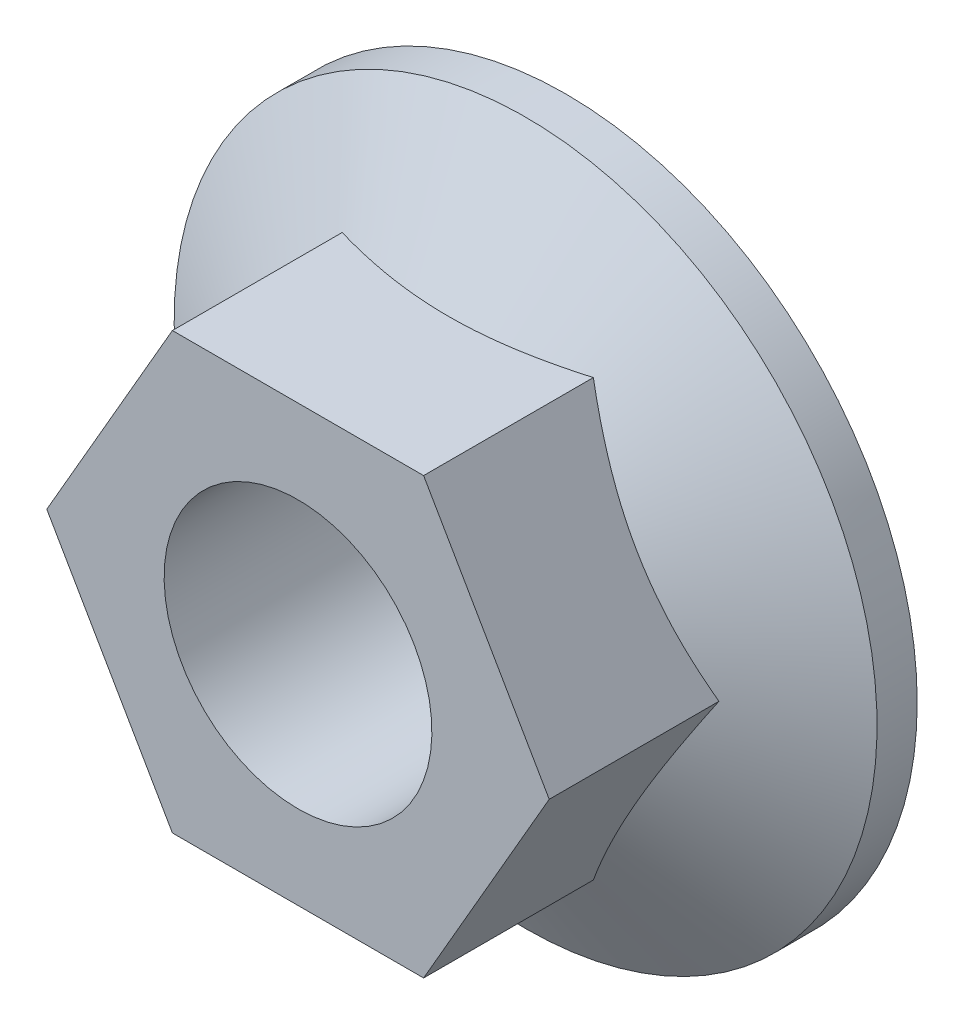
ISO-10303-21;
HEADER;
FILE_DESCRIPTION(('STEP AP214'),'2;1');
FILE_NAME('part.step','',(''),(''),'','','');
FILE_SCHEMA(('AUTOMOTIVE_DESIGN { 1 0 10303 214 1 1 1 1 }'));
ENDSEC;
DATA;
#1=APPLICATION_CONTEXT('core data for automotive mechanical design processes');
#2=APPLICATION_PROTOCOL_DEFINITION('international standard','automotive_design',2000,#1);
#3=PRODUCT_CONTEXT('',#1,'mechanical');
#4=PRODUCT('Part','Part','',(#3));
#5=PRODUCT_RELATED_PRODUCT_CATEGORY('part','',(#4));
#6=PRODUCT_DEFINITION_FORMATION('','',#4);
#7=PRODUCT_DEFINITION_CONTEXT('part definition',#1,'design');
#8=PRODUCT_DEFINITION('design','',#6,#7);
#9=PRODUCT_DEFINITION_SHAPE('','',#8);
#10=(LENGTH_UNIT() NAMED_UNIT(*) SI_UNIT(.MILLI.,.METRE.));
#11=(NAMED_UNIT(*) PLANE_ANGLE_UNIT() SI_UNIT($,.RADIAN.));
#12=(NAMED_UNIT(*) SI_UNIT($,.STERADIAN.) SOLID_ANGLE_UNIT());
#13=UNCERTAINTY_MEASURE_WITH_UNIT(LENGTH_MEASURE(1.E-05),#10,'distance_accuracy_value','');
#14=(GEOMETRIC_REPRESENTATION_CONTEXT(3) GLOBAL_UNCERTAINTY_ASSIGNED_CONTEXT((#13)) GLOBAL_UNIT_ASSIGNED_CONTEXT((#10,
#11,#12)) REPRESENTATION_CONTEXT('',''));
#15=CARTESIAN_POINT('',(0.,0.,0.));
#16=DIRECTION('',(0.,0.,1.));
#17=DIRECTION('',(1.,0.,0.));
#18=AXIS2_PLACEMENT_3D('',#15,#16,#17);
#19=CARTESIAN_POINT('',(-4.12805442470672,6.49999999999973,8.2535577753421));
#20=DIRECTION('',(0.,1.,0.));
#21=DIRECTION('',(-1.,0.,0.));
#22=AXIS2_PLACEMENT_3D('',#19,#20,#21);
#23=PLANE('',#22);
#24=DIRECTION('',(0.,0.,1.));
#25=VECTOR('',#24,1.);
#26=CARTESIAN_POINT('',(-3.75277674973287,6.49999999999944,8.2535577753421));
#27=LINE('',#26,#25);
#28=CARTESIAN_POINT('',(-3.75277674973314,6.4999999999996,8.));
#29=VERTEX_POINT('',#28);
#30=CARTESIAN_POINT('',(-3.7527767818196,6.4999999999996,2.92884447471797));
#31=VERTEX_POINT('',#30);
#32=EDGE_CURVE('E79',#29,#31,#27,.F.);
#33=ORIENTED_EDGE('',*,*,#32,.F.);
#34=DIRECTION('',(1.,0.,0.));
#35=VECTOR('',#34,1.);
#36=CARTESIAN_POINT('',(8.25610884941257,6.49999999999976,8.));
#37=LINE('',#36,#35);
#38=CARTESIAN_POINT('',(3.75277674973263,6.50000000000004,8.));
#39=VERTEX_POINT('',#38);
#40=EDGE_CURVE('E91',#29,#39,#37,.T.);
#41=ORIENTED_EDGE('',*,*,#40,.T.);
#42=DIRECTION('',(0.,0.,1.));
#43=VECTOR('',#42,1.);
#44=CARTESIAN_POINT('',(3.75277674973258,6.50000000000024,8.2535577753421));
#45=LINE('',#44,#43);
#46=CARTESIAN_POINT('',(3.75277673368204,6.5000000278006,2.92884447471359));
#47=VERTEX_POINT('',#46);
#48=EDGE_CURVE('E195',#47,#39,#45,.T.);
#49=ORIENTED_EDGE('',*,*,#48,.F.);
#50=CARTESIAN_POINT('',(-3.75277680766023,6.49999996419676,2.9288444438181));
#51=CARTESIAN_POINT('',(-3.44471104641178,6.49999998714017,3.01778469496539));
#52=CARTESIAN_POINT('',(-3.13420821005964,6.49999999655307,3.09921200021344));
#53=CARTESIAN_POINT('',(-2.50815863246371,6.5000000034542,3.24312465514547));
#54=CARTESIAN_POINT('',(-2.1926022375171,6.50000000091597,3.30556762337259));
#55=CARTESIAN_POINT('',(-1.56503027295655,6.49999999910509,3.40598347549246));
#56=CARTESIAN_POINT('',(-1.253103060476,6.49999999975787,3.44449173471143));
#57=CARTESIAN_POINT('',(-0.627449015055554,6.50000000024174,3.49618678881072));
#58=CARTESIAN_POINT('',(-0.313724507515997,6.50000000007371,3.5094010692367));
#59=CARTESIAN_POINT('',(0.3137244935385,6.49999999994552,3.50940106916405));
#60=CARTESIAN_POINT('',(0.627448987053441,6.49999999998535,3.49618678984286));
#61=CARTESIAN_POINT('',(1.25310300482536,6.50000000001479,3.44449174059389));
#62=CARTESIAN_POINT('',(1.56503020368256,6.50000000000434,3.40598348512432));
#63=CARTESIAN_POINT('',(2.19260214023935,6.4999999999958,3.3055676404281));
#64=CARTESIAN_POINT('',(2.50815852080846,6.49999999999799,3.24312467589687));
#65=CARTESIAN_POINT('',(3.13420807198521,6.50000000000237,3.09921203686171));
#66=CARTESIAN_POINT('',(3.44471089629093,6.50000000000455,3.01778474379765));
#67=CARTESIAN_POINT('',(3.75277664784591,6.50000000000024,2.92884451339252));
#68=B_SPLINE_CURVE_WITH_KNOTS('',3,(#50,#51,#52,#53,#54,#55,#56,#57,#58,#59,#60,#61,#62,#63,#64,
#65,#66,#67),.UNSPECIFIED.,.F.,.F.,(4,2,2,2,2,2,2,2,4),(0.,0.962238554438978,1.92660973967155,
2.8685503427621,3.80946680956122,4.7503832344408,5.69232379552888,6.65669493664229,
7.61893344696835),.UNSPECIFIED.);
#69=EDGE_CURVE('E86',#31,#47,#68,.T.);
#70=ORIENTED_EDGE('',*,*,#69,.F.);
#71=EDGE_LOOP('',(#33,#41,#49,#70));
#72=FACE_BOUND('',#71,.T.);
#73=ADVANCED_FACE('F15',(#72),#23,.T.);
#74=CARTESIAN_POINT('',(3.56513791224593,6.82500000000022,8.2535577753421));
#75=DIRECTION('',(0.866025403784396,0.500000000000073,0.));
#76=DIRECTION('',(-0.500000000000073,0.866025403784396,0.));
#77=AXIS2_PLACEMENT_3D('',#74,#75,#76);
#78=PLANE('',#77);
#79=ORIENTED_EDGE('',*,*,#48,.T.);
#80=DIRECTION('',(0.5,-0.866025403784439,0.));
#81=VECTOR('',#80,1.);
#82=CARTESIAN_POINT('',(3.75277674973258,6.50000000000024,8.));
#83=LINE('',#82,#81);
#84=CARTESIAN_POINT('',(7.50555349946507,6.08125962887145E-13,8.));
#85=VERTEX_POINT('',#84);
#86=EDGE_CURVE('E93',#39,#85,#83,.T.);
#87=ORIENTED_EDGE('',*,*,#86,.T.);
#88=DIRECTION('',(0.,0.,1.));
#89=VECTOR('',#88,1.);
#90=CARTESIAN_POINT('',(7.505553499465,4.87240456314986E-13,8.2535577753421));
#91=LINE('',#90,#89);
#92=CARTESIAN_POINT('',(7.50555349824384,4.62387174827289E-13,2.92884448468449));
#93=VERTEX_POINT('',#92);
#94=EDGE_CURVE('E190',#93,#85,#91,.T.);
#95=ORIENTED_EDGE('',*,*,#94,.F.);
#96=CARTESIAN_POINT('',(3.75277668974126,6.50000003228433,2.92884444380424));
#97=CARTESIAN_POINT('',(3.83526607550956,6.35712427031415,2.97646052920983));
#98=CARTESIAN_POINT('',(3.91806301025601,6.2137157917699,3.02191543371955));
#99=CARTESIAN_POINT('',(4.08432925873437,5.92573421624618,3.10790768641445));
#100=CARTESIAN_POINT('',(4.16779884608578,5.78116064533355,3.14844291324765));
#101=CARTESIAN_POINT('',(4.41954396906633,5.34512529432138,3.26187337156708));
#102=CARTESIAN_POINT('',(4.58881319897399,5.05194239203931,3.32639031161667));
#103=CARTESIAN_POINT('',(4.8421214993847,4.61319954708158,3.40204221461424));
#104=CARTESIAN_POINT('',(4.92540378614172,4.46895039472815,3.42359289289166));
#105=CARTESIAN_POINT('',(5.09234461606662,4.17980039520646,3.45972936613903));
#106=CARTESIAN_POINT('',(5.17600312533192,4.03489960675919,3.47431577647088));
#107=CARTESIAN_POINT('',(5.34346539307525,3.74484645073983,3.49615197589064));
#108=CARTESIAN_POINT('',(5.427268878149,3.59969455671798,3.50341009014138));
#109=CARTESIAN_POINT('',(5.59494857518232,3.30926480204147,3.51044185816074));
#110=CARTESIAN_POINT('',(5.67882478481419,3.16398694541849,3.51021574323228));
#111=CARTESIAN_POINT('',(5.90860384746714,2.76599793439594,3.49930951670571));
#112=CARTESIAN_POINT('',(6.0544314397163,2.51341713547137,3.48101004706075));
#113=CARTESIAN_POINT('',(6.34511807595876,2.00993311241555,3.42298852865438));
#114=CARTESIAN_POINT('',(6.48997609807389,1.75903165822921,3.38324665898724));
#115=CARTESIAN_POINT('',(6.78124747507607,1.25453483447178,3.28390597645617));
#116=CARTESIAN_POINT('',(6.92762408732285,1.00100310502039,3.22388637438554));
#117=CARTESIAN_POINT('',(7.21819474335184,0.497719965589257,3.08766703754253));
#118=CARTESIAN_POINT('',(7.36239250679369,0.247962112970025,3.01149928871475));
#119=CARTESIAN_POINT('',(7.50555349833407,1.9605943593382E-09,2.92884448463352));
#120=B_SPLINE_CURVE_WITH_KNOTS('',3,(#96,#97,#98,#99,#100,#101,#102,#103,#104,#105,#106,#107,
#108,#109,#110,#111,#112,#113,#114,#115,#116,#117,#118,#119),.UNSPECIFIED.,.F.,.F.,(4,2,2,2,2,2,
2,2,2,2,2,4),(0.,0.515097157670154,1.03041564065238,2.06319351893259,2.5669347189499,
3.07063140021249,3.57375522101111,4.07686349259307,4.95263090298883,5.82920924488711,
6.72522589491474,7.61948404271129),.UNSPECIFIED.);
#121=EDGE_CURVE('E128',#47,#93,#120,.T.);
#122=ORIENTED_EDGE('',*,*,#121,.F.);
#123=EDGE_LOOP('',(#79,#87,#95,#122));
#124=FACE_BOUND('',#123,.T.);
#125=ADVANCED_FACE('F137',(#124),#78,.T.);
#126=CARTESIAN_POINT('',(7.69319233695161,0.325000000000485,8.2535577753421));
#127=DIRECTION('',(0.866025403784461,-0.499999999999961,0.));
#128=DIRECTION('',(0.499999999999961,0.866025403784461,0.));
#129=AXIS2_PLACEMENT_3D('',#126,#127,#128);
#130=PLANE('',#129);
#131=ORIENTED_EDGE('',*,*,#94,.T.);
#132=DIRECTION('',(-0.499999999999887,-0.866025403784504,0.));
#133=VECTOR('',#132,1.);
#134=CARTESIAN_POINT('',(7.505553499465,4.8919202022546E-13,8.));
#135=LINE('',#134,#133);
#136=CARTESIAN_POINT('',(3.75277674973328,-6.49999999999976,8.));
#137=VERTEX_POINT('',#136);
#138=EDGE_CURVE('E210',#85,#137,#135,.T.);
#139=ORIENTED_EDGE('',*,*,#138,.T.);
#140=DIRECTION('',(0.,0.,1.));
#141=VECTOR('',#140,1.);
#142=CARTESIAN_POINT('',(3.75277674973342,-6.49999999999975,8.2535577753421));
#143=LINE('',#142,#141);
#144=CARTESIAN_POINT('',(3.75277678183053,-6.49999999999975,2.92884447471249));
#145=VERTEX_POINT('',#144);
#146=EDGE_CURVE('E185',#145,#137,#143,.T.);
#147=ORIENTED_EDGE('',*,*,#146,.F.);
#148=CARTESIAN_POINT('',(7.50555349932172,-2.5099739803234E-09,2.92884448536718));
#149=CARTESIAN_POINT('',(7.42306413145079,-0.142875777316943,2.97646055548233));
#150=CARTESIAN_POINT('',(7.34026720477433,-0.286284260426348,3.02191545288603));
#151=CARTESIAN_POINT('',(7.17400096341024,-0.574265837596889,3.10790769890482));
#152=CARTESIAN_POINT('',(7.09053137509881,-0.718839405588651,3.14844292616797));
#153=CARTESIAN_POINT('',(6.83878625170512,-1.15487475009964,3.26187338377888));
#154=CARTESIAN_POINT('',(6.6695170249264,-1.44805765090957,3.32639032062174));
#155=CARTESIAN_POINT('',(6.41620872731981,-1.88680049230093,3.4020422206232));
#156=CARTESIAN_POINT('',(6.33292644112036,-2.03104964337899,3.42359289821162));
#157=CARTESIAN_POINT('',(6.16598561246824,-2.32019964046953,3.45972937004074));
#158=CARTESIAN_POINT('',(6.0823271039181,-2.46510042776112,3.47431577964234));
#159=CARTESIAN_POINT('',(5.91486483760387,-2.75515358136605,3.49615197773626));
#160=CARTESIAN_POINT('',(5.83106135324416,-2.9003054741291,3.50341009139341));
#161=CARTESIAN_POINT('',(5.66338165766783,-3.19073522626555,3.51044185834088));
#162=CARTESIAN_POINT('',(5.5795054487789,-3.33601308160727,3.51021574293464));
#163=CARTESIAN_POINT('',(5.34972639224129,-3.73400208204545,3.49930951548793));
#164=CARTESIAN_POINT('',(5.20389880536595,-3.98658287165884,3.48101004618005));
#165=CARTESIAN_POINT('',(4.91321217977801,-4.49006687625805,3.42298853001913));
#166=CARTESIAN_POINT('',(4.76835416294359,-4.74096832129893,3.38324666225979));
#167=CARTESIAN_POINT('',(4.47708279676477,-5.24546512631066,3.28390598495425));
#168=CARTESIAN_POINT('',(4.33070619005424,-5.49899684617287,3.2238863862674));
#169=CARTESIAN_POINT('',(4.04013554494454,-6.00227996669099,3.08766705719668));
#170=CARTESIAN_POINT('',(3.89593778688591,-6.2520378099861,3.01149931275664));
#171=CARTESIAN_POINT('',(3.75277680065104,-6.49999991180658,2.92884451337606));
#172=B_SPLINE_CURVE_WITH_KNOTS('',3,(#148,#149,#150,#151,#152,#153,#154,#155,#156,#157,#158,
#159,#160,#161,#162,#163,#164,#165,#166,#167,#168,#169,#170,#171),.UNSPECIFIED.,.F.,.F.,(4,2,2,
2,2,2,2,2,2,2,2,4),(0.,0.5150971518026,1.03041562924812,2.06319349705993,2.56693469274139,
3.07063136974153,3.57375518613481,4.0768634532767,4.95263083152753,5.82920914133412,
6.7252257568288,7.61948387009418),.UNSPECIFIED.);
#173=EDGE_CURVE('E95',#93,#145,#172,.T.);
#174=ORIENTED_EDGE('',*,*,#173,.F.);
#175=EDGE_LOOP('',(#131,#139,#147,#174));
#176=FACE_BOUND('',#175,.T.);
#177=ADVANCED_FACE('F133',(#176),#130,.T.);
#178=CARTESIAN_POINT('',(4.12805442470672,-6.49999999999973,8.2535577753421));
#179=DIRECTION('',(0.,-1.,0.));
#180=DIRECTION('',(1.,0.,0.));
#181=AXIS2_PLACEMENT_3D('',#178,#179,#180);
#182=PLANE('',#181);
#183=ORIENTED_EDGE('',*,*,#146,.T.);
#184=DIRECTION('',(1.,0.,0.));
#185=VECTOR('',#184,1.);
#186=CARTESIAN_POINT('',(8.25610884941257,-6.49999999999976,8.));
#187=LINE('',#186,#185);
#188=CARTESIAN_POINT('',(-3.75277674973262,-6.50000000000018,8.));
#189=VERTEX_POINT('',#188);
#190=EDGE_CURVE('E202',#137,#189,#187,.F.);
#191=ORIENTED_EDGE('',*,*,#190,.T.);
#192=DIRECTION('',(0.,0.,1.));
#193=VECTOR('',#192,1.);
#194=CARTESIAN_POINT('',(-3.75277674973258,-6.50000000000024,8.2535577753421));
#195=LINE('',#194,#193);
#196=CARTESIAN_POINT('',(-3.75277673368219,-6.50000002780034,2.92884447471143));
#197=VERTEX_POINT('',#196);
#198=EDGE_CURVE('E181',#197,#189,#195,.T.);
#199=ORIENTED_EDGE('',*,*,#198,.F.);
#200=CARTESIAN_POINT('',(3.75277680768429,-6.49999996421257,2.92884444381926));
#201=CARTESIAN_POINT('',(3.44471104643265,-6.49999998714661,3.017784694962));
#202=CARTESIAN_POINT('',(3.13420821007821,-6.49999999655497,3.09921200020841));
#203=CARTESIAN_POINT('',(2.50815863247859,-6.50000000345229,3.24312465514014));
#204=CARTESIAN_POINT('',(2.1926022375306,-6.5000000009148,3.3055676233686));
#205=CARTESIAN_POINT('',(1.56503027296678,-6.49999999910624,3.40598347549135));
#206=CARTESIAN_POINT('',(1.25310306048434,-6.49999999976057,3.44449173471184));
#207=CARTESIAN_POINT('',(0.627449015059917,-6.50000000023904,3.49618678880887));
#208=CARTESIAN_POINT('',(0.313724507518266,-6.50000000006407,3.50940106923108));
#209=CARTESIAN_POINT('',(-0.31372449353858,-6.49999999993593,3.50940106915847));
#210=CARTESIAN_POINT('',(-0.627448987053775,-6.49999999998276,3.49618678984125));
#211=CARTESIAN_POINT('',(-1.25310300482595,-6.50000000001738,3.44449174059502));
#212=CARTESIAN_POINT('',(-1.56503020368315,-6.50000000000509,3.40598348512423));
#213=CARTESIAN_POINT('',(-2.19260214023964,-6.49999999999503,3.30556764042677));
#214=CARTESIAN_POINT('',(-2.50815852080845,-6.49999999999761,3.24312467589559));
#215=CARTESIAN_POINT('',(-3.13420807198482,-6.50000000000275,3.09921203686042));
#216=CARTESIAN_POINT('',(-3.44471089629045,-6.50000000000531,3.0177847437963));
#217=CARTESIAN_POINT('',(-3.75277664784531,-6.50000000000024,2.92884451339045));
#218=B_SPLINE_CURVE_WITH_KNOTS('',3,(#200,#201,#202,#203,#204,#205,#206,#207,#208,#209,#210,
#211,#212,#213,#214,#215,#216,#217),.UNSPECIFIED.,.F.,.F.,(4,2,2,2,2,2,2,2,4),(0.,
0.962238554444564,1.92660973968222,2.86855034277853,3.80946680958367,4.75038323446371,
5.69232379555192,6.65669493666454,7.61893344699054),.UNSPECIFIED.);
#219=EDGE_CURVE('E90',#145,#197,#218,.T.);
#220=ORIENTED_EDGE('',*,*,#219,.F.);
#221=EDGE_LOOP('',(#183,#191,#199,#220));
#222=FACE_BOUND('',#221,.T.);
#223=ADVANCED_FACE('F136',(#222),#182,.T.);
#224=CARTESIAN_POINT('',(-3.56513791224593,-6.82500000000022,8.2535577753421));
#225=DIRECTION('',(-0.866025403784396,-0.500000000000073,0.));
#226=DIRECTION('',(0.500000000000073,-0.866025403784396,0.));
#227=AXIS2_PLACEMENT_3D('',#224,#225,#226);
#228=PLANE('',#227);
#229=ORIENTED_EDGE('',*,*,#198,.T.);
#230=DIRECTION('',(-0.499999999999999,0.866025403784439,0.));
#231=VECTOR('',#230,1.);
#232=CARTESIAN_POINT('',(-3.75277674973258,-6.50000000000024,8.));
#233=LINE('',#232,#231);
#234=CARTESIAN_POINT('',(-7.505553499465,-4.86700295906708E-13,8.));
#235=VERTEX_POINT('',#234);
#236=EDGE_CURVE('E40',#189,#235,#233,.T.);
#237=ORIENTED_EDGE('',*,*,#236,.T.);
#238=DIRECTION('',(0.,0.,1.));
#239=VECTOR('',#238,1.);
#240=CARTESIAN_POINT('',(-7.505553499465,-4.86698355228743E-13,8.2535577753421));
#241=LINE('',#240,#239);
#242=CARTESIAN_POINT('',(-7.50555349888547,1.05714558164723E-09,2.92884448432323));
#243=VERTEX_POINT('',#242);
#244=EDGE_CURVE('E70',#243,#235,#241,.T.);
#245=ORIENTED_EDGE('',*,*,#244,.F.);
#246=CARTESIAN_POINT('',(-3.75277668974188,-6.50000003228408,2.92884444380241));
#247=CARTESIAN_POINT('',(-3.83526607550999,-6.3571242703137,2.97646052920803));
#248=CARTESIAN_POINT('',(-3.91806301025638,-6.21371579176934,3.02191543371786));
#249=CARTESIAN_POINT('',(-4.08432925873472,-5.92573421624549,3.10790768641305));
#250=CARTESIAN_POINT('',(-4.16779884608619,-5.78116064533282,3.14844291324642));
#251=CARTESIAN_POINT('',(-4.41954396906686,-5.34512529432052,3.26187337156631));
#252=CARTESIAN_POINT('',(-4.58881319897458,-5.05194239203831,3.32639031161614));
#253=CARTESIAN_POINT('',(-4.84212149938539,-4.61319954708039,3.40204221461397));
#254=CARTESIAN_POINT('',(-4.92540378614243,-4.46895039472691,3.42359289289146));
#255=CARTESIAN_POINT('',(-5.0923446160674,-4.17980039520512,3.45972936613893));
#256=CARTESIAN_POINT('',(-5.17600312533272,-4.0348996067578,3.47431577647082));
#257=CARTESIAN_POINT('',(-5.34346539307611,-3.74484645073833,3.49615197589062));
#258=CARTESIAN_POINT('',(-5.42726887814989,-3.59969455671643,3.50341009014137));
#259=CARTESIAN_POINT('',(-5.59494857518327,-3.30926480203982,3.5104418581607));
#260=CARTESIAN_POINT('',(-5.67882478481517,-3.16398694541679,3.51021574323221));
#261=CARTESIAN_POINT('',(-5.90860384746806,-2.76599793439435,3.49930951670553));
#262=CARTESIAN_POINT('',(-6.05443143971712,-2.51341713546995,3.48101004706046));
#263=CARTESIAN_POINT('',(-6.34511807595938,-2.00993311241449,3.42298852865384));
#264=CARTESIAN_POINT('',(-6.48997609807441,-1.75903165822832,3.38324665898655));
#265=CARTESIAN_POINT('',(-6.78124747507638,-1.25453483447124,3.28390597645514));
#266=CARTESIAN_POINT('',(-6.92762408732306,-1.00100310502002,3.22388637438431));
#267=CARTESIAN_POINT('',(-7.21819474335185,-0.49771996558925,3.08766703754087));
#268=CARTESIAN_POINT('',(-7.36239250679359,-0.247962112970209,3.01149928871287));
#269=CARTESIAN_POINT('',(-7.50555349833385,-1.96098023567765E-09,2.9288444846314));
#270=B_SPLINE_CURVE_WITH_KNOTS('',3,(#246,#247,#248,#249,#250,#251,#252,#253,#254,#255,#256,
#257,#258,#259,#260,#261,#262,#263,#264,#265,#266,#267,#268,#269),.UNSPECIFIED.,.F.,.F.,(4,2,2,
2,2,2,2,2,2,2,2,4),(0.,0.515097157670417,1.03041564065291,2.06319351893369,2.56693471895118,
3.07063140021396,3.57375522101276,4.0768634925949,4.9526309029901,5.8292092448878,
6.72522589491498,7.61948404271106),.UNSPECIFIED.);
#271=EDGE_CURVE('E74',#197,#243,#270,.T.);
#272=ORIENTED_EDGE('',*,*,#271,.F.);
#273=EDGE_LOOP('',(#229,#237,#245,#272));
#274=FACE_BOUND('',#273,.T.);
#275=ADVANCED_FACE('F72',(#274),#228,.T.);
#276=CARTESIAN_POINT('',(-7.69319233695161,-0.325000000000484,8.2535577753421));
#277=DIRECTION('',(-0.866025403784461,0.499999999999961,0.));
#278=DIRECTION('',(-0.499999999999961,-0.866025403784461,0.));
#279=AXIS2_PLACEMENT_3D('',#276,#277,#278);
#280=PLANE('',#279);
#281=ORIENTED_EDGE('',*,*,#244,.T.);
#282=DIRECTION('',(0.499999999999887,0.866025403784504,0.));
#283=VECTOR('',#282,1.);
#284=CARTESIAN_POINT('',(-7.505553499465,-4.87457296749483E-13,8.));
#285=LINE('',#284,#283);
#286=EDGE_CURVE('E173',#235,#29,#285,.T.);
#287=ORIENTED_EDGE('',*,*,#286,.T.);
#288=ORIENTED_EDGE('',*,*,#32,.T.);
#289=CARTESIAN_POINT('',(-7.50555349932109,2.50911462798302E-09,2.92884448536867));
#290=CARTESIAN_POINT('',(-7.42306413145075,0.142875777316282,2.97646055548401));
#291=CARTESIAN_POINT('',(-7.34026720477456,0.286284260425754,3.02191545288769));
#292=CARTESIAN_POINT('',(-7.17400096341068,0.574265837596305,3.10790769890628));
#293=CARTESIAN_POINT('',(-7.09053137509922,0.718839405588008,3.14844292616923));
#294=CARTESIAN_POINT('',(-6.83878625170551,1.15487475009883,3.26187338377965));
#295=CARTESIAN_POINT('',(-6.66951702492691,1.44805765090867,3.3263903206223));
#296=CARTESIAN_POINT('',(-6.41620872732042,1.88680049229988,3.4020422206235));
#297=CARTESIAN_POINT('',(-6.33292644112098,2.0310496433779,3.42359289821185));
#298=CARTESIAN_POINT('',(-6.16598561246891,2.32019964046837,3.45972937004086));
#299=CARTESIAN_POINT('',(-6.08232710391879,2.46510042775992,3.47431577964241));
#300=CARTESIAN_POINT('',(-5.9148648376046,2.75515358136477,3.49615197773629));
#301=CARTESIAN_POINT('',(-5.83106135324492,2.90030547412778,3.50341009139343));
#302=CARTESIAN_POINT('',(-5.66338165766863,3.19073522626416,3.51044185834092));
#303=CARTESIAN_POINT('',(-5.57950544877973,3.33601308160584,3.5102157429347));
#304=CARTESIAN_POINT('',(-5.34972639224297,3.73400208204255,3.49930951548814));
#305=CARTESIAN_POINT('',(-5.20389880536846,3.9865828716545,3.48101004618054));
#306=CARTESIAN_POINT('',(-4.91321217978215,4.49006687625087,3.4229885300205));
#307=CARTESIAN_POINT('',(-4.76835416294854,4.74096832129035,3.38324666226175));
#308=CARTESIAN_POINT('',(-4.47708279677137,5.24546512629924,3.28390598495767));
#309=CARTESIAN_POINT('',(-4.33070619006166,5.49899684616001,3.22388638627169));
#310=CARTESIAN_POINT('',(-4.04013554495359,6.00227996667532,3.08766705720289));
#311=CARTESIAN_POINT('',(-3.89593778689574,6.25203780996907,3.0114993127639));
#312=CARTESIAN_POINT('',(-3.75277680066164,6.49999991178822,2.92884451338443));
#313=B_SPLINE_CURVE_WITH_KNOTS('',3,(#289,#290,#291,#292,#293,#294,#295,#296,#297,#298,#299,
#300,#301,#302,#303,#304,#305,#306,#307,#308,#309,#310,#311,#312),.UNSPECIFIED.,.F.,.F.,(4,2,2,
2,2,2,2,2,2,2,2,4),(0.,0.51509715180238,1.03041562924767,2.06319349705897,2.56693469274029,
3.07063136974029,3.57375518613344,4.0768634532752,4.95263083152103,5.8292091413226,
6.72522575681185,7.61948387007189),.UNSPECIFIED.);
#314=EDGE_CURVE('E19',#243,#31,#313,.T.);
#315=ORIENTED_EDGE('',*,*,#314,.F.);
#316=EDGE_LOOP('',(#281,#287,#288,#315));
#317=FACE_BOUND('',#316,.T.);
#318=ADVANCED_FACE('F83',(#317),#280,.T.);
#319=CARTESIAN_POINT('',(0.,0.,1.19999998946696));
#320=DIRECTION('',(0.,0.,-1.));
#321=DIRECTION('',(0.,1.,0.));
#322=AXIS2_PLACEMENT_3D('',#319,#320,#321);
#323=CONICAL_SURFACE('',#322,10.4999999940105,1.04719754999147);
#324=ORIENTED_EDGE('',*,*,#314,.T.);
#325=ORIENTED_EDGE('',*,*,#69,.T.);
#326=ORIENTED_EDGE('',*,*,#121,.T.);
#327=ORIENTED_EDGE('',*,*,#173,.T.);
#328=ORIENTED_EDGE('',*,*,#219,.T.);
#329=ORIENTED_EDGE('',*,*,#271,.T.);
#330=EDGE_LOOP('',(#324,#325,#326,#327,#328,#329));
#331=FACE_BOUND('',#330,.T.);
#332=CARTESIAN_POINT('',(0.,0.,1.2));
#333=DIRECTION('',(0.,0.,1.));
#334=DIRECTION('',(0.,-1.,0.));
#335=AXIS2_PLACEMENT_3D('',#332,#333,#334);
#336=CIRCLE('',#335,10.5);
#337=CARTESIAN_POINT('',(0.,-10.5,1.2));
#338=VERTEX_POINT('',#337);
#339=EDGE_CURVE('E172',#338,#338,#336,.F.);
#340=ORIENTED_EDGE('',*,*,#339,.F.);
#341=EDGE_LOOP('',(#340));
#342=FACE_BOUND('',#341,.T.);
#343=ADVANCED_FACE('F87',(#331,#342),#323,.T.);
#344=CARTESIAN_POINT('',(8.25610884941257,-7.14999999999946,8.));
#345=DIRECTION('',(0.,0.,-1.));
#346=DIRECTION('',(0.,1.,0.));
#347=AXIS2_PLACEMENT_3D('',#344,#345,#346);
#348=PLANE('',#347);
#349=CARTESIAN_POINT('',(0.,0.,8.));
#350=DIRECTION('',(0.,0.,1.));
#351=DIRECTION('',(0.,-1.,0.));
#352=AXIS2_PLACEMENT_3D('',#349,#350,#351);
#353=CIRCLE('',#352,4.);
#354=CARTESIAN_POINT('',(0.,-4.,8.));
#355=VERTEX_POINT('',#354);
#356=EDGE_CURVE('E104',#355,#355,#353,.F.);
#357=ORIENTED_EDGE('',*,*,#356,.T.);
#358=EDGE_LOOP('',(#357));
#359=FACE_BOUND('',#358,.T.);
#360=ORIENTED_EDGE('',*,*,#236,.F.);
#361=ORIENTED_EDGE('',*,*,#190,.F.);
#362=ORIENTED_EDGE('',*,*,#138,.F.);
#363=ORIENTED_EDGE('',*,*,#86,.F.);
#364=ORIENTED_EDGE('',*,*,#40,.F.);
#365=ORIENTED_EDGE('',*,*,#286,.F.);
#366=EDGE_LOOP('',(#360,#361,#362,#363,#364,#365));
#367=FACE_BOUND('',#366,.T.);
#368=ADVANCED_FACE('F117',(#359,#367),#348,.F.);
#369=CARTESIAN_POINT('',(0.,0.,8.4));
#370=DIRECTION('',(0.,0.,1.));
#371=DIRECTION('',(0.,-1.,0.));
#372=AXIS2_PLACEMENT_3D('',#369,#370,#371);
#373=CYLINDRICAL_SURFACE('',#372,10.5);
#374=CARTESIAN_POINT('',(0.,0.,0.));
#375=DIRECTION('',(0.,0.,1.));
#376=DIRECTION('',(0.,-1.,0.));
#377=AXIS2_PLACEMENT_3D('',#374,#375,#376);
#378=CIRCLE('',#377,10.5);
#379=CARTESIAN_POINT('',(0.,-10.5,0.));
#380=VERTEX_POINT('',#379);
#381=EDGE_CURVE('E31',#380,#380,#378,.F.);
#382=ORIENTED_EDGE('',*,*,#381,.F.);
#383=EDGE_LOOP('',(#382));
#384=FACE_BOUND('',#383,.T.);
#385=ORIENTED_EDGE('',*,*,#339,.T.);
#386=EDGE_LOOP('',(#385));
#387=FACE_BOUND('',#386,.T.);
#388=ADVANCED_FACE('F157',(#384,#387),#373,.T.);
#389=CARTESIAN_POINT('',(0.,0.,8.4));
#390=DIRECTION('',(0.,0.,1.));
#391=DIRECTION('',(0.,-1.,0.));
#392=AXIS2_PLACEMENT_3D('',#389,#390,#391);
#393=CYLINDRICAL_SURFACE('',#392,4.);
#394=CARTESIAN_POINT('',(0.,0.,0.));
#395=DIRECTION('',(0.,0.,1.));
#396=DIRECTION('',(0.,-1.,0.));
#397=AXIS2_PLACEMENT_3D('',#394,#395,#396);
#398=CIRCLE('',#397,4.);
#399=CARTESIAN_POINT('',(0.,-4.,0.));
#400=VERTEX_POINT('',#399);
#401=EDGE_CURVE('E10',#400,#400,#398,.T.);
#402=ORIENTED_EDGE('',*,*,#401,.F.);
#403=EDGE_LOOP('',(#402));
#404=FACE_BOUND('',#403,.T.);
#405=ORIENTED_EDGE('',*,*,#356,.F.);
#406=EDGE_LOOP('',(#405));
#407=FACE_BOUND('',#406,.T.);
#408=ADVANCED_FACE('F151',(#404,#407),#393,.F.);
#409=CARTESIAN_POINT('',(11.5500000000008,-11.5499999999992,0.));
#410=DIRECTION('',(0.,0.,-1.));
#411=DIRECTION('',(0.,1.,0.));
#412=AXIS2_PLACEMENT_3D('',#409,#410,#411);
#413=PLANE('',#412);
#414=ORIENTED_EDGE('',*,*,#401,.T.);
#415=EDGE_LOOP('',(#414));
#416=FACE_BOUND('',#415,.T.);
#417=ORIENTED_EDGE('',*,*,#381,.T.);
#418=EDGE_LOOP('',(#417));
#419=FACE_BOUND('',#418,.T.);
#420=ADVANCED_FACE('F149',(#416,#419),#413,.T.);
#421=CLOSED_SHELL('',(#73,#125,#177,#223,#275,#318,#343,#368,#388,#408,#420));
#422=MANIFOLD_SOLID_BREP('B1',#421);
#423=ADVANCED_BREP_SHAPE_REPRESENTATION('',(#18,#422),#14);
#424=SHAPE_DEFINITION_REPRESENTATION(#9,#423);
ENDSEC;
END-ISO-10303-21;
